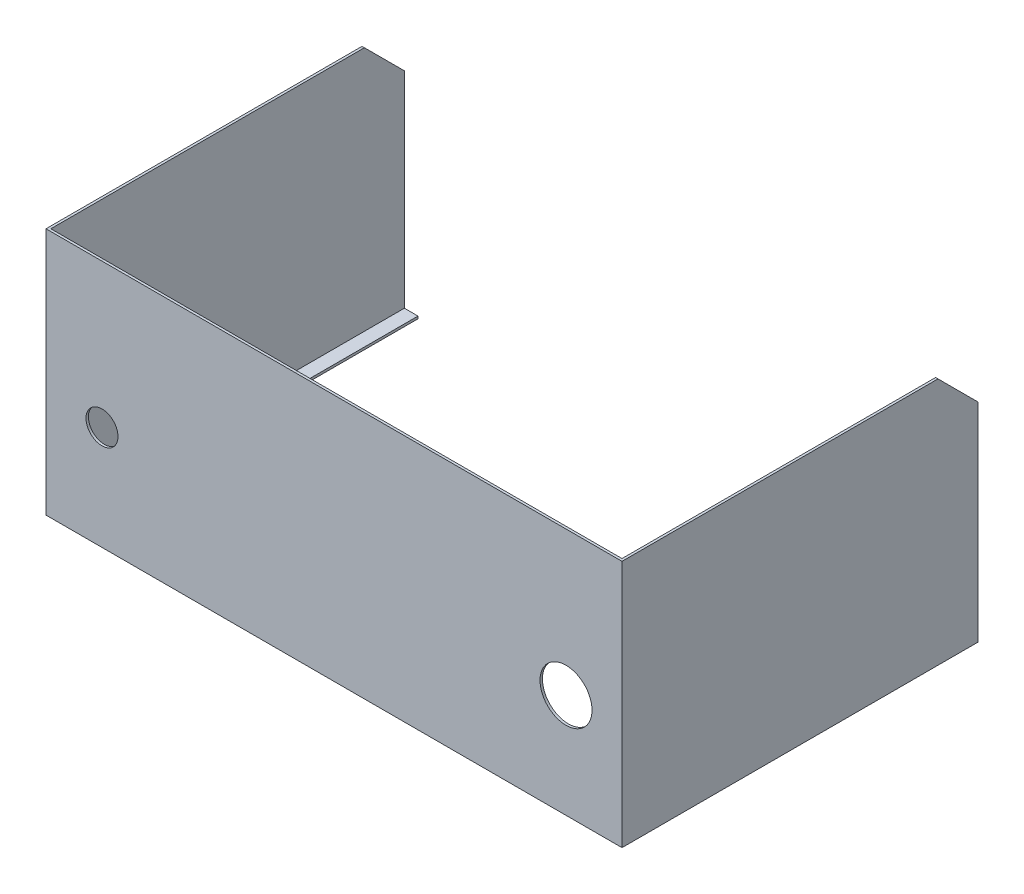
from build123d import *

# Parameters (mm, degrees)
SKETCH_1_W      = 720
SKETCH_1_H      = 310
SKETCH_1_R      = 20
SKETCH_1_R_2    = 32.5
EXTRUDE_1_DEPTH = 3
EXTRUDE_2_DEPTH = 3
EXTRUDE_5_DEPTH = 3
EXTRUDE_8_DEPTH = 3


with BuildPart() as part:
    # Sketch 1 → Extrude 1 (new body)
    with BuildSketch(Plane.XY):
        Rectangle(SKETCH_1_W, SKETCH_1_H)
        with Locations((-290, -25)):
            Circle(SKETCH_1_R, mode=Mode.SUBTRACT)
        with Locations((290, -25)):
            Circle(SKETCH_1_R_2, mode=Mode.SUBTRACT)
    extrude(amount=EXTRUDE_1_DEPTH)

    # Sketch 2 → Extrude 2 (add)
    with BuildSketch(Plane(origin=(360, 0, 0), x_dir=(0, 0, -1), z_dir=(1, 0, 0))):
        Polygon((0, -155), (0, 155), (392, 155), (442, 105), (442, -155), align=None)
    extrude(amount=-EXTRUDE_2_DEPTH)

    # Sketch 3 → Extrude 5 (add)
    with BuildSketch(Plane.ZY.offset(360)):
        Polygon((-442, -155), (0, -155), (0, 155), (-392, 155), (-442, 105), align=None)
    extrude(amount=-EXTRUDE_5_DEPTH)

    # Sketch 5 → Extrude 8 (add)
    with BuildSketch(Plane.XZ.offset(155)):
        Polygon((357, -442), (357, 0), (-357, 0), (-357, -442), (-340, -442), (-340, -17), (340, -17), (340, -442), align=None)
    extrude(amount=-EXTRUDE_8_DEPTH)


solid = part.part
